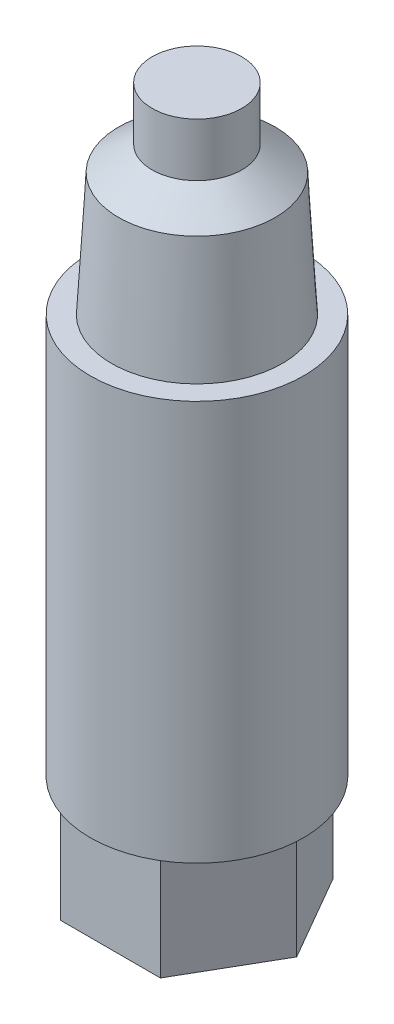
ISO-10303-21;
HEADER;
FILE_DESCRIPTION(('STEP AP214'),'2;1');
FILE_NAME('part.step','',(''),(''),'','','');
FILE_SCHEMA(('AUTOMOTIVE_DESIGN { 1 0 10303 214 1 1 1 1 }'));
ENDSEC;
DATA;
#1=APPLICATION_CONTEXT('core data for automotive mechanical design processes');
#2=APPLICATION_PROTOCOL_DEFINITION('international standard','automotive_design',2000,#1);
#3=PRODUCT_CONTEXT('',#1,'mechanical');
#4=PRODUCT('Part','Part','',(#3));
#5=PRODUCT_RELATED_PRODUCT_CATEGORY('part','',(#4));
#6=PRODUCT_DEFINITION_FORMATION('','',#4);
#7=PRODUCT_DEFINITION_CONTEXT('part definition',#1,'design');
#8=PRODUCT_DEFINITION('design','',#6,#7);
#9=PRODUCT_DEFINITION_SHAPE('','',#8);
#10=(LENGTH_UNIT() NAMED_UNIT(*) SI_UNIT(.MILLI.,.METRE.));
#11=(NAMED_UNIT(*) PLANE_ANGLE_UNIT() SI_UNIT($,.RADIAN.));
#12=(NAMED_UNIT(*) SI_UNIT($,.STERADIAN.) SOLID_ANGLE_UNIT());
#13=UNCERTAINTY_MEASURE_WITH_UNIT(LENGTH_MEASURE(1.E-05),#10,'distance_accuracy_value','');
#14=(GEOMETRIC_REPRESENTATION_CONTEXT(3) GLOBAL_UNCERTAINTY_ASSIGNED_CONTEXT((#13)) GLOBAL_UNIT_ASSIGNED_CONTEXT((#10,
#11,#12)) REPRESENTATION_CONTEXT('',''));
#15=CARTESIAN_POINT('',(0.,0.,0.));
#16=DIRECTION('',(0.,0.,1.));
#17=DIRECTION('',(1.,0.,0.));
#18=AXIS2_PLACEMENT_3D('',#15,#16,#17);
#19=CARTESIAN_POINT('',(0.,60.325,0.));
#20=DIRECTION('',(0.,1.,0.));
#21=DIRECTION('',(0.,0.,1.));
#22=AXIS2_PLACEMENT_3D('',#19,#20,#21);
#23=PLANE('',#22);
#24=CARTESIAN_POINT('',(0.,60.325,0.));
#25=DIRECTION('',(0.,1.,0.));
#26=DIRECTION('',(0.,0.,1.));
#27=AXIS2_PLACEMENT_3D('',#24,#25,#26);
#28=CIRCLE('',#27,12.7);
#29=CARTESIAN_POINT('',(0.,60.325,12.7));
#30=VERTEX_POINT('',#29);
#31=EDGE_CURVE('E127',#30,#30,#28,.T.);
#32=ORIENTED_EDGE('',*,*,#31,.T.);
#33=EDGE_LOOP('',(#32));
#34=FACE_BOUND('',#33,.T.);
#35=CARTESIAN_POINT('',(0.,60.325,0.));
#36=DIRECTION('',(0.,-1.,0.));
#37=DIRECTION('',(0.,0.,-1.));
#38=AXIS2_PLACEMENT_3D('',#35,#36,#37);
#39=CIRCLE('',#38,10.16);
#40=CARTESIAN_POINT('',(0.,60.325,-10.16));
#41=VERTEX_POINT('',#40);
#42=EDGE_CURVE('E147',#41,#41,#39,.T.);
#43=ORIENTED_EDGE('',*,*,#42,.T.);
#44=EDGE_LOOP('',(#43));
#45=FACE_BOUND('',#44,.T.);
#46=ADVANCED_FACE('F31',(#34,#45),#23,.T.);
#47=CARTESIAN_POINT('',(-11.8784044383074,12.7,0.));
#48=DIRECTION('',(0.866025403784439,0.,-0.5));
#49=DIRECTION('',(-0.5,0.,-0.866025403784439));
#50=AXIS2_PLACEMENT_3D('',#47,#48,#49);
#51=PLANE('',#50);
#52=DIRECTION('',(0.5,0.,0.866025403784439));
#53=VECTOR('',#52,1.);
#54=CARTESIAN_POINT('',(-11.8784044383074,0.,0.));
#55=LINE('',#54,#53);
#56=CARTESIAN_POINT('',(-11.8784044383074,0.,0.));
#57=VERTEX_POINT('',#56);
#58=CARTESIAN_POINT('',(-5.93920221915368,0.,10.287));
#59=VERTEX_POINT('',#58);
#60=EDGE_CURVE('E123',#57,#59,#55,.T.);
#61=ORIENTED_EDGE('',*,*,#60,.T.);
#62=DIRECTION('',(0.,-1.,0.));
#63=VECTOR('',#62,1.);
#64=CARTESIAN_POINT('',(-5.93920221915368,12.7,10.287));
#65=LINE('',#64,#63);
#66=CARTESIAN_POINT('',(-5.93920221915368,12.7,10.287));
#67=VERTEX_POINT('',#66);
#68=EDGE_CURVE('E11',#67,#59,#65,.T.);
#69=ORIENTED_EDGE('',*,*,#68,.F.);
#70=DIRECTION('',(0.5,0.,0.866025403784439));
#71=VECTOR('',#70,1.);
#72=CARTESIAN_POINT('',(-11.8784044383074,12.7,0.));
#73=LINE('',#72,#71);
#74=CARTESIAN_POINT('',(-11.8784044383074,12.7,0.));
#75=VERTEX_POINT('',#74);
#76=EDGE_CURVE('E115',#75,#67,#73,.T.);
#77=ORIENTED_EDGE('',*,*,#76,.F.);
#78=DIRECTION('',(0.,-1.,0.));
#79=VECTOR('',#78,1.);
#80=CARTESIAN_POINT('',(-11.8784044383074,12.7,0.));
#81=LINE('',#80,#79);
#82=EDGE_CURVE('E122',#75,#57,#81,.T.);
#83=ORIENTED_EDGE('',*,*,#82,.T.);
#84=EDGE_LOOP('',(#61,#69,#77,#83));
#85=FACE_BOUND('',#84,.T.);
#86=ADVANCED_FACE('F33',(#85),#51,.F.);
#87=CARTESIAN_POINT('',(-5.93920221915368,12.7,10.287));
#88=DIRECTION('',(0.,0.,-1.));
#89=DIRECTION('',(-1.,0.,0.));
#90=AXIS2_PLACEMENT_3D('',#87,#88,#89);
#91=PLANE('',#90);
#92=DIRECTION('',(1.,0.,0.));
#93=VECTOR('',#92,1.);
#94=CARTESIAN_POINT('',(-5.93920221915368,0.,10.287));
#95=LINE('',#94,#93);
#96=CARTESIAN_POINT('',(5.93920221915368,0.,10.287));
#97=VERTEX_POINT('',#96);
#98=EDGE_CURVE('E126',#59,#97,#95,.T.);
#99=ORIENTED_EDGE('',*,*,#98,.T.);
#100=DIRECTION('',(0.,-1.,0.));
#101=VECTOR('',#100,1.);
#102=CARTESIAN_POINT('',(5.93920221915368,12.7,10.287));
#103=LINE('',#102,#101);
#104=CARTESIAN_POINT('',(5.93920221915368,12.7,10.287));
#105=VERTEX_POINT('',#104);
#106=EDGE_CURVE('E40',#105,#97,#103,.T.);
#107=ORIENTED_EDGE('',*,*,#106,.F.);
#108=DIRECTION('',(1.,0.,0.));
#109=VECTOR('',#108,1.);
#110=CARTESIAN_POINT('',(-5.93920221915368,12.7,10.287));
#111=LINE('',#110,#109);
#112=EDGE_CURVE('E84',#67,#105,#111,.T.);
#113=ORIENTED_EDGE('',*,*,#112,.F.);
#114=ORIENTED_EDGE('',*,*,#68,.T.);
#115=EDGE_LOOP('',(#99,#107,#113,#114));
#116=FACE_BOUND('',#115,.T.);
#117=ADVANCED_FACE('F179',(#116),#91,.F.);
#118=CARTESIAN_POINT('',(5.93920221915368,12.7,10.287));
#119=DIRECTION('',(-0.866025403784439,0.,-0.5));
#120=DIRECTION('',(-0.5,0.,0.866025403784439));
#121=AXIS2_PLACEMENT_3D('',#118,#119,#120);
#122=PLANE('',#121);
#123=DIRECTION('',(0.5,0.,-0.866025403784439));
#124=VECTOR('',#123,1.);
#125=CARTESIAN_POINT('',(5.93920221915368,0.,10.287));
#126=LINE('',#125,#124);
#127=CARTESIAN_POINT('',(11.8784044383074,0.,0.));
#128=VERTEX_POINT('',#127);
#129=EDGE_CURVE('E99',#97,#128,#126,.T.);
#130=ORIENTED_EDGE('',*,*,#129,.T.);
#131=DIRECTION('',(0.,-1.,0.));
#132=VECTOR('',#131,1.);
#133=CARTESIAN_POINT('',(11.8784044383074,12.7,0.));
#134=LINE('',#133,#132);
#135=CARTESIAN_POINT('',(11.8784044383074,12.7,0.));
#136=VERTEX_POINT('',#135);
#137=EDGE_CURVE('E92',#136,#128,#134,.T.);
#138=ORIENTED_EDGE('',*,*,#137,.F.);
#139=DIRECTION('',(0.5,0.,-0.866025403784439));
#140=VECTOR('',#139,1.);
#141=CARTESIAN_POINT('',(5.93920221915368,12.7,10.287));
#142=LINE('',#141,#140);
#143=EDGE_CURVE('E97',#105,#136,#142,.T.);
#144=ORIENTED_EDGE('',*,*,#143,.F.);
#145=ORIENTED_EDGE('',*,*,#106,.T.);
#146=EDGE_LOOP('',(#130,#138,#144,#145));
#147=FACE_BOUND('',#146,.T.);
#148=ADVANCED_FACE('F94',(#147),#122,.F.);
#149=CARTESIAN_POINT('',(11.8784044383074,12.7,0.));
#150=DIRECTION('',(-0.866025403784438,0.,0.5));
#151=DIRECTION('',(0.500000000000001,0.,0.866025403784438));
#152=AXIS2_PLACEMENT_3D('',#149,#150,#151);
#153=PLANE('',#152);
#154=DIRECTION('',(-0.5,0.,-0.866025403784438));
#155=VECTOR('',#154,1.);
#156=CARTESIAN_POINT('',(11.8784044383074,0.,0.));
#157=LINE('',#156,#155);
#158=CARTESIAN_POINT('',(5.93920221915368,0.,-10.287));
#159=VERTEX_POINT('',#158);
#160=EDGE_CURVE('E130',#128,#159,#157,.T.);
#161=ORIENTED_EDGE('',*,*,#160,.T.);
#162=DIRECTION('',(0.,-1.,0.));
#163=VECTOR('',#162,1.);
#164=CARTESIAN_POINT('',(5.93920221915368,12.7,-10.287));
#165=LINE('',#164,#163);
#166=CARTESIAN_POINT('',(5.93920221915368,12.7,-10.287));
#167=VERTEX_POINT('',#166);
#168=EDGE_CURVE('E102',#167,#159,#165,.T.);
#169=ORIENTED_EDGE('',*,*,#168,.F.);
#170=DIRECTION('',(-0.5,0.,-0.866025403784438));
#171=VECTOR('',#170,1.);
#172=CARTESIAN_POINT('',(11.8784044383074,12.7,0.));
#173=LINE('',#172,#171);
#174=EDGE_CURVE('E105',#136,#167,#173,.T.);
#175=ORIENTED_EDGE('',*,*,#174,.F.);
#176=ORIENTED_EDGE('',*,*,#137,.T.);
#177=EDGE_LOOP('',(#161,#169,#175,#176));
#178=FACE_BOUND('',#177,.T.);
#179=ADVANCED_FACE('F106',(#178),#153,.F.);
#180=CARTESIAN_POINT('',(5.93920221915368,12.7,-10.287));
#181=DIRECTION('',(0.,0.,1.));
#182=DIRECTION('',(1.,0.,0.));
#183=AXIS2_PLACEMENT_3D('',#180,#181,#182);
#184=PLANE('',#183);
#185=DIRECTION('',(-1.,0.,0.));
#186=VECTOR('',#185,1.);
#187=CARTESIAN_POINT('',(5.93920221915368,0.,-10.287));
#188=LINE('',#187,#186);
#189=CARTESIAN_POINT('',(-5.93920221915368,0.,-10.287));
#190=VERTEX_POINT('',#189);
#191=EDGE_CURVE('E70',#159,#190,#188,.T.);
#192=ORIENTED_EDGE('',*,*,#191,.T.);
#193=DIRECTION('',(0.,-1.,0.));
#194=VECTOR('',#193,1.);
#195=CARTESIAN_POINT('',(-5.93920221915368,12.7,-10.287));
#196=LINE('',#195,#194);
#197=CARTESIAN_POINT('',(-5.93920221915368,12.7,-10.287));
#198=VERTEX_POINT('',#197);
#199=EDGE_CURVE('E48',#198,#190,#196,.T.);
#200=ORIENTED_EDGE('',*,*,#199,.F.);
#201=DIRECTION('',(-1.,0.,0.));
#202=VECTOR('',#201,1.);
#203=CARTESIAN_POINT('',(5.93920221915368,12.7,-10.287));
#204=LINE('',#203,#202);
#205=EDGE_CURVE('E109',#167,#198,#204,.T.);
#206=ORIENTED_EDGE('',*,*,#205,.F.);
#207=ORIENTED_EDGE('',*,*,#168,.T.);
#208=EDGE_LOOP('',(#192,#200,#206,#207));
#209=FACE_BOUND('',#208,.T.);
#210=ADVANCED_FACE('F139',(#209),#184,.F.);
#211=CARTESIAN_POINT('',(-5.93920221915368,12.7,-10.287));
#212=DIRECTION('',(0.866025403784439,0.,0.5));
#213=DIRECTION('',(0.5,0.,-0.866025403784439));
#214=AXIS2_PLACEMENT_3D('',#211,#212,#213);
#215=PLANE('',#214);
#216=DIRECTION('',(-0.5,0.,0.866025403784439));
#217=VECTOR('',#216,1.);
#218=CARTESIAN_POINT('',(-5.93920221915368,0.,-10.287));
#219=LINE('',#218,#217);
#220=EDGE_CURVE('E76',#190,#57,#219,.T.);
#221=ORIENTED_EDGE('',*,*,#220,.T.);
#222=ORIENTED_EDGE('',*,*,#82,.F.);
#223=DIRECTION('',(-0.5,0.,0.866025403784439));
#224=VECTOR('',#223,1.);
#225=CARTESIAN_POINT('',(-5.93920221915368,12.7,-10.287));
#226=LINE('',#225,#224);
#227=EDGE_CURVE('E120',#198,#75,#226,.T.);
#228=ORIENTED_EDGE('',*,*,#227,.F.);
#229=ORIENTED_EDGE('',*,*,#199,.T.);
#230=EDGE_LOOP('',(#221,#222,#228,#229));
#231=FACE_BOUND('',#230,.T.);
#232=ADVANCED_FACE('F141',(#231),#215,.F.);
#233=CARTESIAN_POINT('',(-5.93920221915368,0.,10.287));
#234=DIRECTION('',(0.,1.,0.));
#235=DIRECTION('',(0.,0.,1.));
#236=AXIS2_PLACEMENT_3D('',#233,#234,#235);
#237=PLANE('',#236);
#238=ORIENTED_EDGE('',*,*,#60,.F.);
#239=ORIENTED_EDGE('',*,*,#220,.F.);
#240=ORIENTED_EDGE('',*,*,#191,.F.);
#241=ORIENTED_EDGE('',*,*,#160,.F.);
#242=ORIENTED_EDGE('',*,*,#129,.F.);
#243=ORIENTED_EDGE('',*,*,#98,.F.);
#244=EDGE_LOOP('',(#238,#239,#240,#241,#242,#243));
#245=FACE_BOUND('',#244,.T.);
#246=ADVANCED_FACE('F138',(#245),#237,.F.);
#247=CARTESIAN_POINT('',(0.,12.7,0.));
#248=DIRECTION('',(0.,1.,0.));
#249=DIRECTION('',(0.,0.,1.));
#250=AXIS2_PLACEMENT_3D('',#247,#248,#249);
#251=PLANE('',#250);
#252=CARTESIAN_POINT('',(0.,12.7,0.));
#253=DIRECTION('',(0.,1.,0.));
#254=DIRECTION('',(0.,0.,1.));
#255=AXIS2_PLACEMENT_3D('',#252,#253,#254);
#256=CIRCLE('',#255,12.7);
#257=CARTESIAN_POINT('',(0.,12.7,12.7));
#258=VERTEX_POINT('',#257);
#259=EDGE_CURVE('E144',#258,#258,#256,.T.);
#260=ORIENTED_EDGE('',*,*,#259,.F.);
#261=EDGE_LOOP('',(#260));
#262=FACE_BOUND('',#261,.T.);
#263=ORIENTED_EDGE('',*,*,#227,.T.);
#264=ORIENTED_EDGE('',*,*,#76,.T.);
#265=ORIENTED_EDGE('',*,*,#112,.T.);
#266=ORIENTED_EDGE('',*,*,#143,.T.);
#267=ORIENTED_EDGE('',*,*,#174,.T.);
#268=ORIENTED_EDGE('',*,*,#205,.T.);
#269=EDGE_LOOP('',(#263,#264,#265,#266,#267,#268));
#270=FACE_BOUND('',#269,.T.);
#271=ADVANCED_FACE('F112',(#262,#270),#251,.F.);
#272=CARTESIAN_POINT('',(0.,60.325,0.));
#273=DIRECTION('',(0.,-1.,0.));
#274=DIRECTION('',(0.,0.,-1.));
#275=AXIS2_PLACEMENT_3D('',#272,#273,#274);
#276=CYLINDRICAL_SURFACE('',#275,12.7);
#277=ORIENTED_EDGE('',*,*,#31,.F.);
#278=EDGE_LOOP('',(#277));
#279=FACE_BOUND('',#278,.T.);
#280=ORIENTED_EDGE('',*,*,#259,.T.);
#281=EDGE_LOOP('',(#280));
#282=FACE_BOUND('',#281,.T.);
#283=ADVANCED_FACE('F187',(#279,#282),#276,.T.);
#284=CARTESIAN_POINT('',(0.,74.9744062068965,0.));
#285=DIRECTION('',(0.,-1.,0.));
#286=DIRECTION('',(0.,0.,-1.));
#287=AXIS2_PLACEMENT_3D('',#284,#285,#286);
#288=CONICAL_SURFACE('',#287,9.33449999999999,0.0562908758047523);
#289=ORIENTED_EDGE('',*,*,#42,.F.);
#290=EDGE_LOOP('',(#289));
#291=FACE_BOUND('',#290,.T.);
#292=CARTESIAN_POINT('',(0.,74.9744062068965,0.));
#293=DIRECTION('',(0.,-1.,0.));
#294=DIRECTION('',(0.,0.,-1.));
#295=AXIS2_PLACEMENT_3D('',#292,#293,#294);
#296=CIRCLE('',#295,9.33449999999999);
#297=CARTESIAN_POINT('',(0.,74.9744062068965,-9.33449999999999));
#298=VERTEX_POINT('',#297);
#299=EDGE_CURVE('E152',#298,#298,#296,.T.);
#300=ORIENTED_EDGE('',*,*,#299,.T.);
#301=EDGE_LOOP('',(#300));
#302=FACE_BOUND('',#301,.T.);
#303=ADVANCED_FACE('F183',(#291,#302),#288,.T.);
#304=CARTESIAN_POINT('',(0.,77.8734980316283,0.));
#305=DIRECTION('',(0.,-1.,0.));
#306=DIRECTION('',(0.,0.,-1.));
#307=AXIS2_PLACEMENT_3D('',#304,#305,#306);
#308=CONICAL_SURFACE('',#307,5.334,0.943696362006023);
#309=ORIENTED_EDGE('',*,*,#299,.F.);
#310=EDGE_LOOP('',(#309));
#311=FACE_BOUND('',#310,.T.);
#312=CARTESIAN_POINT('',(0.,77.8734980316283,0.));
#313=DIRECTION('',(0.,-1.,0.));
#314=DIRECTION('',(0.,0.,-1.));
#315=AXIS2_PLACEMENT_3D('',#312,#313,#314);
#316=CIRCLE('',#315,5.334);
#317=CARTESIAN_POINT('',(0.,77.8734980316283,-5.334));
#318=VERTEX_POINT('',#317);
#319=EDGE_CURVE('E155',#318,#318,#316,.T.);
#320=ORIENTED_EDGE('',*,*,#319,.T.);
#321=EDGE_LOOP('',(#320));
#322=FACE_BOUND('',#321,.T.);
#323=ADVANCED_FACE('F170',(#311,#322),#308,.T.);
#324=CARTESIAN_POINT('',(0.,60.325,0.));
#325=DIRECTION('',(0.,-1.,0.));
#326=DIRECTION('',(0.,0.,-1.));
#327=AXIS2_PLACEMENT_3D('',#324,#325,#326);
#328=CYLINDRICAL_SURFACE('',#327,5.334);
#329=ORIENTED_EDGE('',*,*,#319,.F.);
#330=EDGE_LOOP('',(#329));
#331=FACE_BOUND('',#330,.T.);
#332=CARTESIAN_POINT('',(0.,84.2234980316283,0.));
#333=DIRECTION('',(0.,-1.,0.));
#334=DIRECTION('',(0.,0.,-1.));
#335=AXIS2_PLACEMENT_3D('',#332,#333,#334);
#336=CIRCLE('',#335,5.334);
#337=CARTESIAN_POINT('',(0.,84.2234980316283,-5.334));
#338=VERTEX_POINT('',#337);
#339=EDGE_CURVE('E158',#338,#338,#336,.T.);
#340=ORIENTED_EDGE('',*,*,#339,.T.);
#341=EDGE_LOOP('',(#340));
#342=FACE_BOUND('',#341,.T.);
#343=ADVANCED_FACE('F162',(#331,#342),#328,.T.);
#344=CARTESIAN_POINT('',(-5.334,84.2234980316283,0.));
#345=DIRECTION('',(0.,-1.,0.));
#346=DIRECTION('',(0.,0.,-1.));
#347=AXIS2_PLACEMENT_3D('',#344,#345,#346);
#348=PLANE('',#347);
#349=ORIENTED_EDGE('',*,*,#339,.F.);
#350=EDGE_LOOP('',(#349));
#351=FACE_BOUND('',#350,.T.);
#352=ADVANCED_FACE('F164',(#351),#348,.F.);
#353=CLOSED_SHELL('',(#46,#86,#117,#148,#179,#210,#232,#246,#271,#283,#303,#323,#343,#352));
#354=MANIFOLD_SOLID_BREP('B2',#353);
#355=ADVANCED_BREP_SHAPE_REPRESENTATION('',(#18,#354),#14);
#356=SHAPE_DEFINITION_REPRESENTATION(#9,#355);
ENDSEC;
END-ISO-10303-21;
